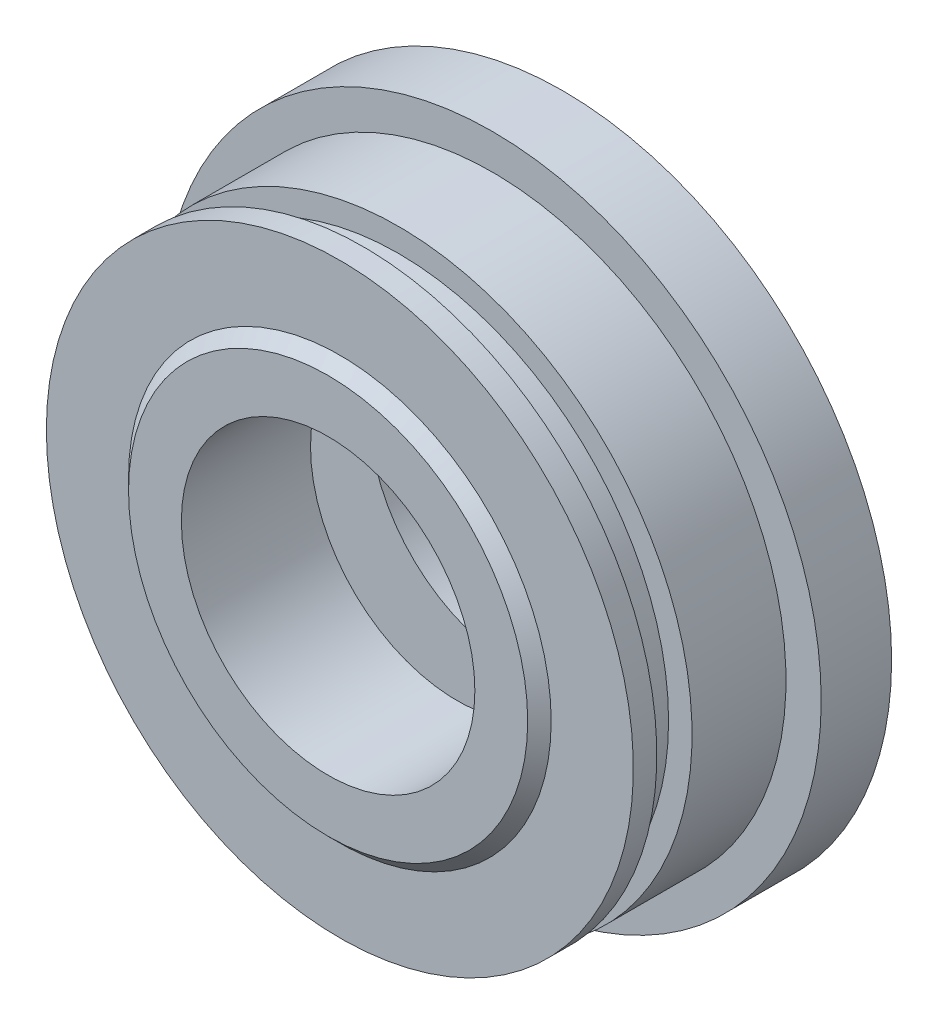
ISO-10303-21;
HEADER;
FILE_DESCRIPTION(('STEP AP214'),'2;1');
FILE_NAME('part.step','',(''),(''),'','','');
FILE_SCHEMA(('AUTOMOTIVE_DESIGN { 1 0 10303 214 1 1 1 1 }'));
ENDSEC;
DATA;
#1=APPLICATION_CONTEXT('core data for automotive mechanical design processes');
#2=APPLICATION_PROTOCOL_DEFINITION('international standard','automotive_design',2000,#1);
#3=PRODUCT_CONTEXT('',#1,'mechanical');
#4=PRODUCT('Part','Part','',(#3));
#5=PRODUCT_RELATED_PRODUCT_CATEGORY('part','',(#4));
#6=PRODUCT_DEFINITION_FORMATION('','',#4);
#7=PRODUCT_DEFINITION_CONTEXT('part definition',#1,'design');
#8=PRODUCT_DEFINITION('design','',#6,#7);
#9=PRODUCT_DEFINITION_SHAPE('','',#8);
#10=(LENGTH_UNIT() NAMED_UNIT(*) SI_UNIT(.MILLI.,.METRE.));
#11=(NAMED_UNIT(*) PLANE_ANGLE_UNIT() SI_UNIT($,.RADIAN.));
#12=(NAMED_UNIT(*) SI_UNIT($,.STERADIAN.) SOLID_ANGLE_UNIT());
#13=UNCERTAINTY_MEASURE_WITH_UNIT(LENGTH_MEASURE(1.E-05),#10,'distance_accuracy_value','');
#14=(GEOMETRIC_REPRESENTATION_CONTEXT(3) GLOBAL_UNCERTAINTY_ASSIGNED_CONTEXT((#13)) GLOBAL_UNIT_ASSIGNED_CONTEXT((#10,
#11,#12)) REPRESENTATION_CONTEXT('',''));
#15=CARTESIAN_POINT('',(0.,0.,0.));
#16=DIRECTION('',(0.,0.,1.));
#17=DIRECTION('',(1.,0.,0.));
#18=AXIS2_PLACEMENT_3D('',#15,#16,#17);
#19=CARTESIAN_POINT('',(0.,0.,9.5));
#20=DIRECTION('',(0.,0.,-1.));
#21=DIRECTION('',(-1.,0.,0.));
#22=AXIS2_PLACEMENT_3D('',#19,#20,#21);
#23=CYLINDRICAL_SURFACE('',#22,12.5);
#24=CARTESIAN_POINT('',(0.,0.,8.5));
#25=DIRECTION('',(0.,0.,1.));
#26=DIRECTION('',(1.,0.,0.));
#27=AXIS2_PLACEMENT_3D('',#24,#25,#26);
#28=CIRCLE('',#27,12.5);
#29=CARTESIAN_POINT('',(-12.5,0.,8.50000000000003));
#30=VERTEX_POINT('',#29);
#31=EDGE_CURVE('E35',#30,#30,#28,.T.);
#32=CARTESIAN_POINT('',(0.,0.,9.5));
#33=DIRECTION('',(0.,0.,1.));
#34=DIRECTION('',(1.,0.,0.));
#35=AXIS2_PLACEMENT_3D('',#32,#33,#34);
#36=CIRCLE('',#35,12.5);
#37=CARTESIAN_POINT('',(-12.5,0.,9.50000000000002));
#38=VERTEX_POINT('',#37);
#39=EDGE_CURVE('E52',#38,#38,#36,.T.);
#40=CARTESIAN_POINT('',(-12.5,0.,8.50000000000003));
#41=CARTESIAN_POINT('',(-12.5,0.,8.51041666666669));
#42=CARTESIAN_POINT('',(-12.5,0.,8.52083333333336));
#43=CARTESIAN_POINT('',(-12.5,0.,8.54166666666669));
#44=CARTESIAN_POINT('',(-12.5,0.,8.55208333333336));
#45=CARTESIAN_POINT('',(-12.5,0.,8.57291666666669));
#46=CARTESIAN_POINT('',(-12.5,0.,8.58333333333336));
#47=CARTESIAN_POINT('',(-12.5,0.,8.60416666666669));
#48=CARTESIAN_POINT('',(-12.5,0.,8.61458333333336));
#49=CARTESIAN_POINT('',(-12.5,0.,8.63541666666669));
#50=CARTESIAN_POINT('',(-12.5,0.,8.64583333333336));
#51=CARTESIAN_POINT('',(-12.5,0.,8.66666666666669));
#52=CARTESIAN_POINT('',(-12.5,0.,8.67708333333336));
#53=CARTESIAN_POINT('',(-12.5,0.,8.69791666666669));
#54=CARTESIAN_POINT('',(-12.5,0.,8.70833333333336));
#55=CARTESIAN_POINT('',(-12.5,0.,8.72916666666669));
#56=CARTESIAN_POINT('',(-12.5,0.,8.73958333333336));
#57=CARTESIAN_POINT('',(-12.5,0.,8.76041666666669));
#58=CARTESIAN_POINT('',(-12.5,0.,8.77083333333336));
#59=CARTESIAN_POINT('',(-12.5,0.,8.79166666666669));
#60=CARTESIAN_POINT('',(-12.5,0.,8.80208333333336));
#61=CARTESIAN_POINT('',(-12.5,0.,8.82291666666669));
#62=CARTESIAN_POINT('',(-12.5,0.,8.83333333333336));
#63=CARTESIAN_POINT('',(-12.5,0.,8.85416666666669));
#64=CARTESIAN_POINT('',(-12.5,0.,8.86458333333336));
#65=CARTESIAN_POINT('',(-12.5,0.,8.88541666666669));
#66=CARTESIAN_POINT('',(-12.5,0.,8.89583333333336));
#67=CARTESIAN_POINT('',(-12.5,0.,8.91666666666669));
#68=CARTESIAN_POINT('',(-12.5,0.,8.92708333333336));
#69=CARTESIAN_POINT('',(-12.5,0.,8.94791666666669));
#70=CARTESIAN_POINT('',(-12.5,0.,8.95833333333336));
#71=CARTESIAN_POINT('',(-12.5,0.,8.97916666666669));
#72=CARTESIAN_POINT('',(-12.5,0.,8.98958333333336));
#73=CARTESIAN_POINT('',(-12.5,0.,9.01041666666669));
#74=CARTESIAN_POINT('',(-12.5,0.,9.02083333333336));
#75=CARTESIAN_POINT('',(-12.5,0.,9.04166666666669));
#76=CARTESIAN_POINT('',(-12.5,0.,9.05208333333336));
#77=CARTESIAN_POINT('',(-12.5,0.,9.07291666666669));
#78=CARTESIAN_POINT('',(-12.5,0.,9.08333333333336));
#79=CARTESIAN_POINT('',(-12.5,0.,9.10416666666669));
#80=CARTESIAN_POINT('',(-12.5,0.,9.11458333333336));
#81=CARTESIAN_POINT('',(-12.5,0.,9.13541666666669));
#82=CARTESIAN_POINT('',(-12.5,0.,9.14583333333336));
#83=CARTESIAN_POINT('',(-12.5,0.,9.16666666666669));
#84=CARTESIAN_POINT('',(-12.5,0.,9.17708333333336));
#85=CARTESIAN_POINT('',(-12.5,0.,9.19791666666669));
#86=CARTESIAN_POINT('',(-12.5,0.,9.20833333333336));
#87=CARTESIAN_POINT('',(-12.5,0.,9.22916666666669));
#88=CARTESIAN_POINT('',(-12.5,0.,9.23958333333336));
#89=CARTESIAN_POINT('',(-12.5,0.,9.26041666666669));
#90=CARTESIAN_POINT('',(-12.5,0.,9.27083333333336));
#91=CARTESIAN_POINT('',(-12.5,0.,9.29166666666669));
#92=CARTESIAN_POINT('',(-12.5,0.,9.30208333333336));
#93=CARTESIAN_POINT('',(-12.5,0.,9.32291666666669));
#94=CARTESIAN_POINT('',(-12.5,0.,9.33333333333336));
#95=CARTESIAN_POINT('',(-12.5,0.,9.35416666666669));
#96=CARTESIAN_POINT('',(-12.5,0.,9.36458333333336));
#97=CARTESIAN_POINT('',(-12.5,0.,9.38541666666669));
#98=CARTESIAN_POINT('',(-12.5,0.,9.39583333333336));
#99=CARTESIAN_POINT('',(-12.5,0.,9.41666666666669));
#100=CARTESIAN_POINT('',(-12.5,0.,9.42708333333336));
#101=CARTESIAN_POINT('',(-12.5,0.,9.44791666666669));
#102=CARTESIAN_POINT('',(-12.5,0.,9.45833333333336));
#103=CARTESIAN_POINT('',(-12.5,0.,9.47916666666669));
#104=CARTESIAN_POINT('',(-12.5,0.,9.48958333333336));
#105=CARTESIAN_POINT('',(-12.5,0.,9.50000000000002));
#106=B_SPLINE_CURVE_WITH_KNOTS('',3,(#40,#41,#42,#43,#44,#45,#46,#47,#48,#49,#50,#51,#52,#53,
#54,#55,#56,#57,#58,#59,#60,#61,#62,#63,#64,#65,#66,#67,#68,#69,#70,#71,#72,#73,#74,#75,#76,#77,
#78,#79,#80,#81,#82,#83,#84,#85,#86,#87,#88,#89,#90,#91,#92,#93,#94,#95,#96,#97,#98,#99,#100,
#101,#102,#103,#104,#105),.UNSPECIFIED.,.F.,.F.,(4,2,2,2,2,2,2,2,2,2,2,2,2,2,2,2,2,2,2,2,2,2,2,
2,2,2,2,2,2,2,2,2,4),(0.,0.0312499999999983,0.0624999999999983,0.0937499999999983,
0.124999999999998,0.156249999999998,0.187499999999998,0.218749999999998,0.249999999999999,
0.281249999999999,0.312499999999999,0.343749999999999,0.374999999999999,0.406249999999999,
0.437499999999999,0.468749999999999,0.499999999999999,0.531249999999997,0.562499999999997,
0.593749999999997,0.624999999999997,0.656249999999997,0.687499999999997,0.718749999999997,
0.749999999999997,0.781249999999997,0.812499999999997,0.843749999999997,0.874999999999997,
0.906249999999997,0.937499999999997,0.968749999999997,0.999999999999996),.UNSPECIFIED.);
#107=EDGE_CURVE('BSEAM31',#30,#38,#106,.T.);
#108=ORIENTED_EDGE('',*,*,#31,.T.);
#109=ORIENTED_EDGE('',*,*,#39,.F.);
#110=ORIENTED_EDGE('',*,*,#107,.T.);
#111=ORIENTED_EDGE('',*,*,#107,.F.);
#112=EDGE_LOOP('',(#108,#110,#109,#111));
#113=FACE_BOUND('',#112,.T.);
#114=ADVANCED_FACE('F31',(#113),#23,.T.);
#115=CARTESIAN_POINT('',(0.,0.,0.));
#116=DIRECTION('',(0.,0.,1.));
#117=DIRECTION('',(1.,0.,0.));
#118=AXIS2_PLACEMENT_3D('',#115,#116,#117);
#119=CYLINDRICAL_SURFACE('',#118,6.25);
#120=CARTESIAN_POINT('',(0.,0.,2.));
#121=DIRECTION('',(0.,0.,-1.));
#122=DIRECTION('',(-1.,0.,0.));
#123=AXIS2_PLACEMENT_3D('',#120,#121,#122);
#124=CIRCLE('',#123,6.25);
#125=CARTESIAN_POINT('',(-6.25,0.,1.99999999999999));
#126=VERTEX_POINT('',#125);
#127=EDGE_CURVE('E64',#126,#126,#124,.F.);
#128=ORIENTED_EDGE('',*,*,#127,.T.);
#129=EDGE_LOOP('',(#128));
#130=FACE_BOUND('',#129,.T.);
#131=CARTESIAN_POINT('',(0.,0.,0.));
#132=DIRECTION('',(0.,0.,1.));
#133=DIRECTION('',(1.,0.,0.));
#134=AXIS2_PLACEMENT_3D('',#131,#132,#133);
#135=CIRCLE('',#134,6.25);
#136=CARTESIAN_POINT('',(6.25,0.,0.));
#137=VERTEX_POINT('',#136);
#138=EDGE_CURVE('E48',#137,#137,#135,.T.);
#139=ORIENTED_EDGE('',*,*,#138,.F.);
#140=EDGE_LOOP('',(#139));
#141=FACE_BOUND('',#140,.T.);
#142=ADVANCED_FACE('F95',(#130,#141),#119,.F.);
#143=CARTESIAN_POINT('',(0.,0.,3.));
#144=DIRECTION('',(0.,0.,-1.));
#145=DIRECTION('',(-1.,0.,0.));
#146=AXIS2_PLACEMENT_3D('',#143,#144,#145);
#147=CYLINDRICAL_SURFACE('',#146,14.);
#148=CARTESIAN_POINT('',(0.,0.,3.));
#149=DIRECTION('',(0.,0.,1.));
#150=DIRECTION('',(1.,0.,0.));
#151=AXIS2_PLACEMENT_3D('',#148,#149,#150);
#152=CIRCLE('',#151,14.);
#153=CARTESIAN_POINT('',(14.,0.,3.00000000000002));
#154=VERTEX_POINT('',#153);
#155=EDGE_CURVE('E44',#154,#154,#152,.T.);
#156=ORIENTED_EDGE('',*,*,#155,.F.);
#157=EDGE_LOOP('',(#156));
#158=FACE_BOUND('',#157,.T.);
#159=CARTESIAN_POINT('',(0.,0.,0.));
#160=DIRECTION('',(0.,0.,1.));
#161=DIRECTION('',(1.,0.,0.));
#162=AXIS2_PLACEMENT_3D('',#159,#160,#161);
#163=CIRCLE('',#162,14.);
#164=CARTESIAN_POINT('',(14.,0.,0.));
#165=VERTEX_POINT('',#164);
#166=EDGE_CURVE('E56',#165,#165,#163,.T.);
#167=ORIENTED_EDGE('',*,*,#166,.T.);
#168=EDGE_LOOP('',(#167));
#169=FACE_BOUND('',#168,.T.);
#170=ADVANCED_FACE('F33',(#158,#169),#147,.T.);
#171=CARTESIAN_POINT('',(0.,0.,3.));
#172=DIRECTION('',(0.,0.,1.));
#173=DIRECTION('',(1.,0.,0.));
#174=AXIS2_PLACEMENT_3D('',#171,#172,#173);
#175=PLANE('',#174);
#176=CARTESIAN_POINT('',(0.,0.,3.));
#177=DIRECTION('',(0.,0.,1.));
#178=DIRECTION('',(1.,0.,0.));
#179=AXIS2_PLACEMENT_3D('',#176,#177,#178);
#180=CIRCLE('',#179,12.5);
#181=CARTESIAN_POINT('',(-12.5,0.,3.00000000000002));
#182=VERTEX_POINT('',#181);
#183=EDGE_CURVE('E39',#182,#182,#180,.T.);
#184=ORIENTED_EDGE('',*,*,#183,.F.);
#185=EDGE_LOOP('',(#184));
#186=FACE_BOUND('',#185,.T.);
#187=ORIENTED_EDGE('',*,*,#155,.T.);
#188=EDGE_LOOP('',(#187));
#189=FACE_BOUND('',#188,.T.);
#190=ADVANCED_FACE('F104',(#186,#189),#175,.T.);
#191=CARTESIAN_POINT('',(0.,0.,0.));
#192=DIRECTION('',(0.,0.,1.));
#193=DIRECTION('',(1.,0.,0.));
#194=AXIS2_PLACEMENT_3D('',#191,#192,#193);
#195=PLANE('',#194);
#196=ORIENTED_EDGE('',*,*,#138,.T.);
#197=EDGE_LOOP('',(#196));
#198=FACE_BOUND('',#197,.T.);
#199=ORIENTED_EDGE('',*,*,#166,.F.);
#200=EDGE_LOOP('',(#199));
#201=FACE_BOUND('',#200,.T.);
#202=ADVANCED_FACE('F92',(#198,#201),#195,.F.);
#203=CARTESIAN_POINT('',(0.,0.,7.));
#204=DIRECTION('',(0.,0.,-1.));
#205=DIRECTION('',(-1.,0.,0.));
#206=AXIS2_PLACEMENT_3D('',#203,#204,#205);
#207=CIRCLE('',#206,12.5);
#208=CARTESIAN_POINT('',(-12.5,0.,7.00000000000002));
#209=VERTEX_POINT('',#208);
#210=EDGE_CURVE('E68',#209,#209,#207,.T.);
#211=CARTESIAN_POINT('',(-12.5,0.,7.00000000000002));
#212=CARTESIAN_POINT('',(-12.5,0.,6.95833333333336));
#213=CARTESIAN_POINT('',(-12.5,0.,6.91666666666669));
#214=CARTESIAN_POINT('',(-12.5,0.,6.83333333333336));
#215=CARTESIAN_POINT('',(-12.5,0.,6.79166666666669));
#216=CARTESIAN_POINT('',(-12.5,0.,6.70833333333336));
#217=CARTESIAN_POINT('',(-12.5,0.,6.66666666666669));
#218=CARTESIAN_POINT('',(-12.5,0.,6.58333333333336));
#219=CARTESIAN_POINT('',(-12.5,0.,6.54166666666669));
#220=CARTESIAN_POINT('',(-12.5,0.,6.45833333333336));
#221=CARTESIAN_POINT('',(-12.5,0.,6.41666666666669));
#222=CARTESIAN_POINT('',(-12.5,0.,6.33333333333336));
#223=CARTESIAN_POINT('',(-12.5,0.,6.29166666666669));
#224=CARTESIAN_POINT('',(-12.5,0.,6.20833333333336));
#225=CARTESIAN_POINT('',(-12.5,0.,6.16666666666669));
#226=CARTESIAN_POINT('',(-12.5,0.,6.08333333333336));
#227=CARTESIAN_POINT('',(-12.5,0.,6.04166666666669));
#228=CARTESIAN_POINT('',(-12.5,0.,5.95833333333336));
#229=CARTESIAN_POINT('',(-12.5,0.,5.91666666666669));
#230=CARTESIAN_POINT('',(-12.5,0.,5.83333333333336));
#231=CARTESIAN_POINT('',(-12.5,0.,5.79166666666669));
#232=CARTESIAN_POINT('',(-12.5,0.,5.70833333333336));
#233=CARTESIAN_POINT('',(-12.5,0.,5.66666666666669));
#234=CARTESIAN_POINT('',(-12.5,0.,5.58333333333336));
#235=CARTESIAN_POINT('',(-12.5,0.,5.54166666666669));
#236=CARTESIAN_POINT('',(-12.5,0.,5.45833333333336));
#237=CARTESIAN_POINT('',(-12.5,0.,5.41666666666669));
#238=CARTESIAN_POINT('',(-12.5,0.,5.33333333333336));
#239=CARTESIAN_POINT('',(-12.5,0.,5.29166666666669));
#240=CARTESIAN_POINT('',(-12.5,0.,5.20833333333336));
#241=CARTESIAN_POINT('',(-12.5,0.,5.16666666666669));
#242=CARTESIAN_POINT('',(-12.5,0.,5.08333333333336));
#243=CARTESIAN_POINT('',(-12.5,0.,5.04166666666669));
#244=CARTESIAN_POINT('',(-12.5,0.,4.95833333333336));
#245=CARTESIAN_POINT('',(-12.5,0.,4.91666666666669));
#246=CARTESIAN_POINT('',(-12.5,0.,4.83333333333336));
#247=CARTESIAN_POINT('',(-12.5,0.,4.79166666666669));
#248=CARTESIAN_POINT('',(-12.5,0.,4.70833333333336));
#249=CARTESIAN_POINT('',(-12.5,0.,4.66666666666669));
#250=CARTESIAN_POINT('',(-12.5,0.,4.58333333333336));
#251=CARTESIAN_POINT('',(-12.5,0.,4.54166666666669));
#252=CARTESIAN_POINT('',(-12.5,0.,4.45833333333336));
#253=CARTESIAN_POINT('',(-12.5,0.,4.41666666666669));
#254=CARTESIAN_POINT('',(-12.5,0.,4.33333333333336));
#255=CARTESIAN_POINT('',(-12.5,0.,4.29166666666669));
#256=CARTESIAN_POINT('',(-12.5,0.,4.20833333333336));
#257=CARTESIAN_POINT('',(-12.5,0.,4.16666666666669));
#258=CARTESIAN_POINT('',(-12.5,0.,4.08333333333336));
#259=CARTESIAN_POINT('',(-12.5,0.,4.04166666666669));
#260=CARTESIAN_POINT('',(-12.5,0.,3.95833333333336));
#261=CARTESIAN_POINT('',(-12.5,0.,3.91666666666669));
#262=CARTESIAN_POINT('',(-12.5,0.,3.83333333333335));
#263=CARTESIAN_POINT('',(-12.5,0.,3.79166666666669));
#264=CARTESIAN_POINT('',(-12.5,0.,3.70833333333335));
#265=CARTESIAN_POINT('',(-12.5,0.,3.66666666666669));
#266=CARTESIAN_POINT('',(-12.5,0.,3.58333333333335));
#267=CARTESIAN_POINT('',(-12.5,0.,3.54166666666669));
#268=CARTESIAN_POINT('',(-12.5,0.,3.45833333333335));
#269=CARTESIAN_POINT('',(-12.5,0.,3.41666666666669));
#270=CARTESIAN_POINT('',(-12.5,0.,3.33333333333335));
#271=CARTESIAN_POINT('',(-12.5,0.,3.29166666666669));
#272=CARTESIAN_POINT('',(-12.5,0.,3.20833333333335));
#273=CARTESIAN_POINT('',(-12.5,0.,3.16666666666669));
#274=CARTESIAN_POINT('',(-12.5,0.,3.08333333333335));
#275=CARTESIAN_POINT('',(-12.5,0.,3.04166666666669));
#276=CARTESIAN_POINT('',(-12.5,0.,3.00000000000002));
#277=B_SPLINE_CURVE_WITH_KNOTS('',3,(#211,#212,#213,#214,#215,#216,#217,#218,#219,#220,#221,
#222,#223,#224,#225,#226,#227,#228,#229,#230,#231,#232,#233,#234,#235,#236,#237,#238,#239,#240,
#241,#242,#243,#244,#245,#246,#247,#248,#249,#250,#251,#252,#253,#254,#255,#256,#257,#258,#259,
#260,#261,#262,#263,#264,#265,#266,#267,#268,#269,#270,#271,#272,#273,#274,#275,#276),
.UNSPECIFIED.,.F.,.F.,(4,2,2,2,2,2,2,2,2,2,2,2,2,2,2,2,2,2,2,2,2,2,2,2,2,2,2,2,2,2,2,2,4),(0.,
0.125,0.25,0.375,0.5,0.625000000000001,0.750000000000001,0.875000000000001,1.,1.125,1.25,1.375,
1.5,1.625,1.75,1.875,2.,2.125,2.25,2.375,2.5,2.625,2.75,2.875,3.,3.125,3.25,3.375,3.5,3.625,
3.75,3.875,4.),.UNSPECIFIED.);
#278=EDGE_CURVE('BSEAM108',#209,#182,#277,.T.);
#279=ORIENTED_EDGE('',*,*,#210,.T.);
#280=ORIENTED_EDGE('',*,*,#183,.T.);
#281=ORIENTED_EDGE('',*,*,#278,.T.);
#282=ORIENTED_EDGE('',*,*,#278,.F.);
#283=EDGE_LOOP('',(#279,#281,#280,#282));
#284=FACE_BOUND('',#283,.T.);
#285=ADVANCED_FACE('F108',(#284),#23,.T.);
#286=CARTESIAN_POINT('',(0.,0.,9.5));
#287=DIRECTION('',(0.,0.,1.));
#288=DIRECTION('',(1.,0.,0.));
#289=AXIS2_PLACEMENT_3D('',#286,#287,#288);
#290=PLANE('',#289);
#291=CARTESIAN_POINT('',(0.,0.,9.5));
#292=DIRECTION('',(0.,0.,1.));
#293=DIRECTION('',(1.,0.,0.));
#294=AXIS2_PLACEMENT_3D('',#291,#292,#293);
#295=CIRCLE('',#294,9.);
#296=CARTESIAN_POINT('',(9.00000000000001,0.,9.50000000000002));
#297=VERTEX_POINT('',#296);
#298=EDGE_CURVE('E10',#297,#297,#295,.T.);
#299=ORIENTED_EDGE('',*,*,#298,.F.);
#300=EDGE_LOOP('',(#299));
#301=FACE_BOUND('',#300,.T.);
#302=ORIENTED_EDGE('',*,*,#39,.T.);
#303=EDGE_LOOP('',(#302));
#304=FACE_BOUND('',#303,.T.);
#305=ADVANCED_FACE('F154',(#301,#304),#290,.T.);
#306=CARTESIAN_POINT('',(0.,0.,9.5));
#307=DIRECTION('',(0.,0.,-1.));
#308=DIRECTION('',(1.,0.,0.));
#309=AXIS2_PLACEMENT_3D('',#306,#307,#308);
#310=CONICAL_SURFACE('',#309,9.,0.78539816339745);
#311=CARTESIAN_POINT('',(0.,0.,10.));
#312=DIRECTION('',(0.,0.,1.));
#313=DIRECTION('',(1.,0.,0.));
#314=AXIS2_PLACEMENT_3D('',#311,#312,#313);
#315=CIRCLE('',#314,8.5);
#316=CARTESIAN_POINT('',(8.50000000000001,0.,10.));
#317=VERTEX_POINT('',#316);
#318=EDGE_CURVE('E50',#317,#317,#315,.T.);
#319=ORIENTED_EDGE('',*,*,#318,.F.);
#320=EDGE_LOOP('',(#319));
#321=FACE_BOUND('',#320,.T.);
#322=ORIENTED_EDGE('',*,*,#298,.T.);
#323=EDGE_LOOP('',(#322));
#324=FACE_BOUND('',#323,.T.);
#325=ADVANCED_FACE('F121',(#321,#324),#310,.T.);
#326=CARTESIAN_POINT('',(0.,0.,10.));
#327=DIRECTION('',(0.,0.,1.));
#328=DIRECTION('',(1.,0.,0.));
#329=AXIS2_PLACEMENT_3D('',#326,#327,#328);
#330=PLANE('',#329);
#331=CARTESIAN_POINT('',(0.,0.,10.));
#332=DIRECTION('',(0.,0.,1.));
#333=DIRECTION('',(1.,0.,0.));
#334=AXIS2_PLACEMENT_3D('',#331,#332,#333);
#335=CIRCLE('',#334,6.25);
#336=CARTESIAN_POINT('',(6.25000000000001,0.,10.));
#337=VERTEX_POINT('',#336);
#338=EDGE_CURVE('E67',#337,#337,#335,.T.);
#339=ORIENTED_EDGE('',*,*,#338,.F.);
#340=EDGE_LOOP('',(#339));
#341=FACE_BOUND('',#340,.T.);
#342=ORIENTED_EDGE('',*,*,#318,.T.);
#343=EDGE_LOOP('',(#342));
#344=FACE_BOUND('',#343,.T.);
#345=ADVANCED_FACE('F113',(#341,#344),#330,.T.);
#346=CARTESIAN_POINT('',(0.,0.,4.5));
#347=DIRECTION('',(0.,0.,1.));
#348=DIRECTION('',(1.,0.,0.));
#349=AXIS2_PLACEMENT_3D('',#346,#347,#348);
#350=CIRCLE('',#349,6.25);
#351=CARTESIAN_POINT('',(6.25,0.,4.50000000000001));
#352=VERTEX_POINT('',#351);
#353=EDGE_CURVE('E61',#352,#352,#350,.F.);
#354=ORIENTED_EDGE('',*,*,#353,.T.);
#355=EDGE_LOOP('',(#354));
#356=FACE_BOUND('',#355,.T.);
#357=ORIENTED_EDGE('',*,*,#338,.T.);
#358=EDGE_LOOP('',(#357));
#359=FACE_BOUND('',#358,.T.);
#360=ADVANCED_FACE('F99',(#356,#359),#119,.F.);
#361=CARTESIAN_POINT('',(0.,-5.25,2.));
#362=DIRECTION('',(0.,0.,-1.));
#363=DIRECTION('',(-1.,0.,0.));
#364=AXIS2_PLACEMENT_3D('',#361,#362,#363);
#365=PLANE('',#364);
#366=CARTESIAN_POINT('',(0.,0.,2.));
#367=DIRECTION('',(0.,0.,-1.));
#368=DIRECTION('',(-1.,0.,0.));
#369=AXIS2_PLACEMENT_3D('',#366,#367,#368);
#370=CIRCLE('',#369,10.25);
#371=CARTESIAN_POINT('',(-10.25,0.,1.99999999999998));
#372=VERTEX_POINT('',#371);
#373=EDGE_CURVE('E74',#372,#372,#370,.T.);
#374=ORIENTED_EDGE('',*,*,#373,.F.);
#375=EDGE_LOOP('',(#374));
#376=FACE_BOUND('',#375,.T.);
#377=ORIENTED_EDGE('',*,*,#127,.F.);
#378=EDGE_LOOP('',(#377));
#379=FACE_BOUND('',#378,.T.);
#380=ADVANCED_FACE('F112',(#376,#379),#365,.F.);
#381=CARTESIAN_POINT('',(0.,-10.25,4.5));
#382=DIRECTION('',(0.,0.,1.));
#383=DIRECTION('',(1.,0.,0.));
#384=AXIS2_PLACEMENT_3D('',#381,#382,#383);
#385=PLANE('',#384);
#386=CARTESIAN_POINT('',(0.,0.,4.5));
#387=DIRECTION('',(0.,0.,-1.));
#388=DIRECTION('',(-1.,0.,0.));
#389=AXIS2_PLACEMENT_3D('',#386,#387,#388);
#390=CIRCLE('',#389,10.25);
#391=CARTESIAN_POINT('',(-10.25,0.,4.49999999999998));
#392=VERTEX_POINT('',#391);
#393=EDGE_CURVE('E65',#392,#392,#390,.T.);
#394=ORIENTED_EDGE('',*,*,#393,.T.);
#395=EDGE_LOOP('',(#394));
#396=FACE_BOUND('',#395,.T.);
#397=ORIENTED_EDGE('',*,*,#353,.F.);
#398=EDGE_LOOP('',(#397));
#399=FACE_BOUND('',#398,.T.);
#400=ADVANCED_FACE('F119',(#396,#399),#385,.F.);
#401=CARTESIAN_POINT('',(0.,0.,0.));
#402=DIRECTION('',(0.,0.,-1.));
#403=DIRECTION('',(-1.,0.,0.));
#404=AXIS2_PLACEMENT_3D('',#401,#402,#403);
#405=CYLINDRICAL_SURFACE('',#404,10.25);
#406=ORIENTED_EDGE('',*,*,#373,.T.);
#407=EDGE_LOOP('',(#406));
#408=FACE_BOUND('',#407,.T.);
#409=ORIENTED_EDGE('',*,*,#393,.F.);
#410=EDGE_LOOP('',(#409));
#411=FACE_BOUND('',#410,.T.);
#412=ADVANCED_FACE('F126',(#408,#411),#405,.F.);
#413=CARTESIAN_POINT('',(0.,-14.,8.5));
#414=DIRECTION('',(0.,0.,1.));
#415=DIRECTION('',(1.,0.,0.));
#416=AXIS2_PLACEMENT_3D('',#413,#414,#415);
#417=PLANE('',#416);
#418=CARTESIAN_POINT('',(0.,0.,8.5));
#419=DIRECTION('',(0.,0.,-1.));
#420=DIRECTION('',(-1.,0.,0.));
#421=AXIS2_PLACEMENT_3D('',#418,#419,#420);
#422=CIRCLE('',#421,11.5);
#423=CARTESIAN_POINT('',(-11.5,0.,8.49999999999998));
#424=VERTEX_POINT('',#423);
#425=EDGE_CURVE('E76',#424,#424,#422,.T.);
#426=ORIENTED_EDGE('',*,*,#425,.F.);
#427=EDGE_LOOP('',(#426));
#428=FACE_BOUND('',#427,.T.);
#429=ORIENTED_EDGE('',*,*,#31,.F.);
#430=EDGE_LOOP('',(#429));
#431=FACE_BOUND('',#430,.T.);
#432=ADVANCED_FACE('F132',(#428,#431),#417,.F.);
#433=CARTESIAN_POINT('',(0.,-11.5,7.00000000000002));
#434=DIRECTION('',(0.,0.,-1.));
#435=DIRECTION('',(-1.,0.,0.));
#436=AXIS2_PLACEMENT_3D('',#433,#434,#435);
#437=PLANE('',#436);
#438=CARTESIAN_POINT('',(0.,0.,7.));
#439=DIRECTION('',(0.,0.,-1.));
#440=DIRECTION('',(-1.,0.,0.));
#441=AXIS2_PLACEMENT_3D('',#438,#439,#440);
#442=CIRCLE('',#441,11.5);
#443=CARTESIAN_POINT('',(-11.5,0.,6.99999999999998));
#444=VERTEX_POINT('',#443);
#445=EDGE_CURVE('E70',#444,#444,#442,.T.);
#446=ORIENTED_EDGE('',*,*,#445,.T.);
#447=EDGE_LOOP('',(#446));
#448=FACE_BOUND('',#447,.T.);
#449=ORIENTED_EDGE('',*,*,#210,.F.);
#450=EDGE_LOOP('',(#449));
#451=FACE_BOUND('',#450,.T.);
#452=ADVANCED_FACE('F138',(#448,#451),#437,.F.);
#453=CARTESIAN_POINT('',(0.,0.,0.));
#454=DIRECTION('',(0.,0.,-1.));
#455=DIRECTION('',(-1.,0.,0.));
#456=AXIS2_PLACEMENT_3D('',#453,#454,#455);
#457=CYLINDRICAL_SURFACE('',#456,11.5);
#458=ORIENTED_EDGE('',*,*,#425,.T.);
#459=EDGE_LOOP('',(#458));
#460=FACE_BOUND('',#459,.T.);
#461=ORIENTED_EDGE('',*,*,#445,.F.);
#462=EDGE_LOOP('',(#461));
#463=FACE_BOUND('',#462,.T.);
#464=ADVANCED_FACE('F142',(#460,#463),#457,.T.);
#465=CLOSED_SHELL('',(#114,#142,#170,#190,#202,#285,#305,#325,#345,#360,#380,#400,#412,#432,
#452,#464));
#466=MANIFOLD_SOLID_BREP('B2',#465);
#467=ADVANCED_BREP_SHAPE_REPRESENTATION('',(#18,#466),#14);
#468=SHAPE_DEFINITION_REPRESENTATION(#9,#467);
ENDSEC;
END-ISO-10303-21;
